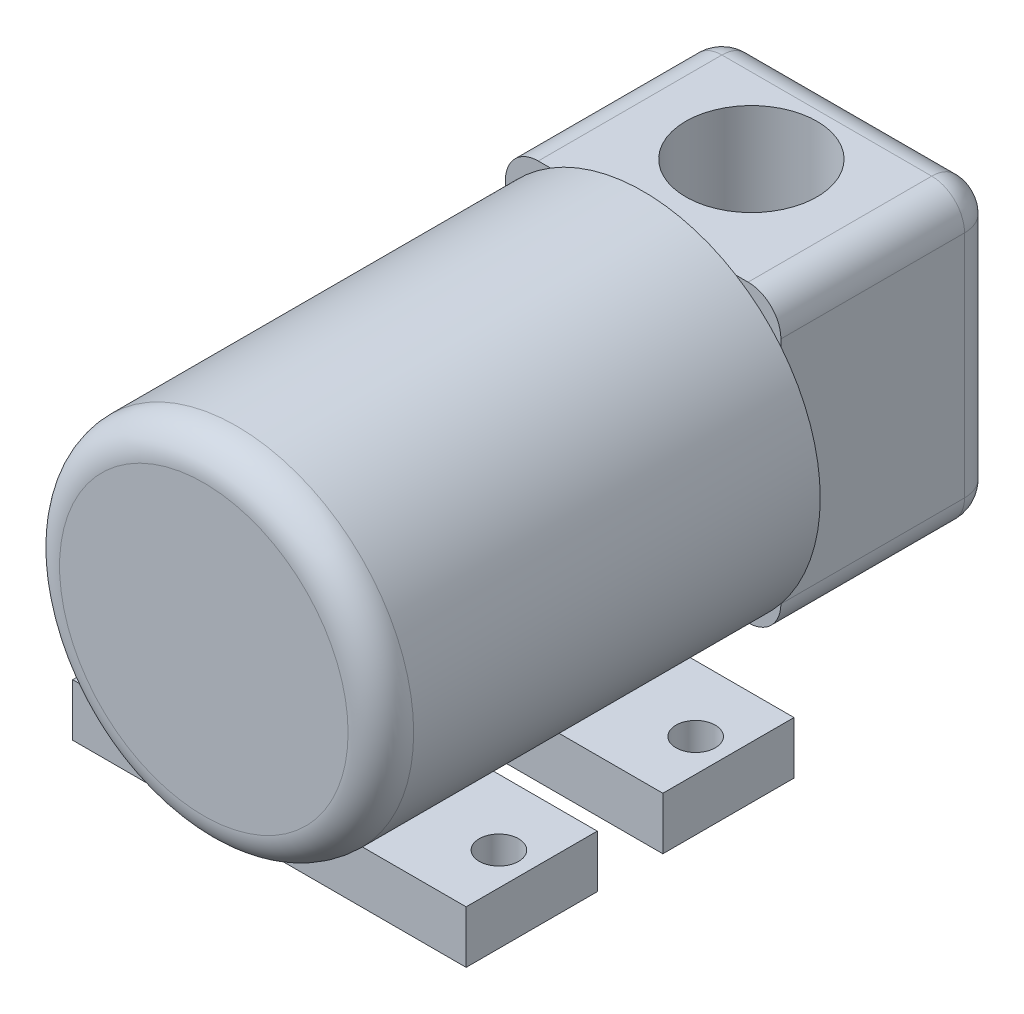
ISO-10303-21;
HEADER;
FILE_DESCRIPTION(('STEP AP214'),'2;1');
FILE_NAME('part.step','',(''),(''),'','','');
FILE_SCHEMA(('AUTOMOTIVE_DESIGN { 1 0 10303 214 1 1 1 1 }'));
ENDSEC;
DATA;
#1=APPLICATION_CONTEXT('core data for automotive mechanical design processes');
#2=APPLICATION_PROTOCOL_DEFINITION('international standard','automotive_design',2000,#1);
#3=PRODUCT_CONTEXT('',#1,'mechanical');
#4=PRODUCT('Part','Part','',(#3));
#5=PRODUCT_RELATED_PRODUCT_CATEGORY('part','',(#4));
#6=PRODUCT_DEFINITION_FORMATION('','',#4);
#7=PRODUCT_DEFINITION_CONTEXT('part definition',#1,'design');
#8=PRODUCT_DEFINITION('design','',#6,#7);
#9=PRODUCT_DEFINITION_SHAPE('','',#8);
#10=(LENGTH_UNIT() NAMED_UNIT(*) SI_UNIT(.MILLI.,.METRE.));
#11=(NAMED_UNIT(*) PLANE_ANGLE_UNIT() SI_UNIT($,.RADIAN.));
#12=(NAMED_UNIT(*) SI_UNIT($,.STERADIAN.) SOLID_ANGLE_UNIT());
#13=UNCERTAINTY_MEASURE_WITH_UNIT(LENGTH_MEASURE(1.E-05),#10,'distance_accuracy_value','');
#14=(GEOMETRIC_REPRESENTATION_CONTEXT(3) GLOBAL_UNCERTAINTY_ASSIGNED_CONTEXT((#13)) GLOBAL_UNIT_ASSIGNED_CONTEXT((#10,
#11,#12)) REPRESENTATION_CONTEXT('',''));
#15=CARTESIAN_POINT('',(0.,0.,0.));
#16=DIRECTION('',(0.,0.,1.));
#17=DIRECTION('',(1.,0.,0.));
#18=AXIS2_PLACEMENT_3D('',#15,#16,#17);
#19=CARTESIAN_POINT('',(0.,0.,-67.));
#20=DIRECTION('',(0.,0.,1.));
#21=DIRECTION('',(1.,0.,0.));
#22=AXIS2_PLACEMENT_3D('',#19,#20,#21);
#23=PLANE('',#22);
#24=DIRECTION('',(0.,-1.,0.));
#25=VECTOR('',#24,1.);
#26=CARTESIAN_POINT('',(21.,23.,-67.));
#27=LINE('',#26,#25);
#28=CARTESIAN_POINT('',(21.,16.9705627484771,-67.));
#29=VERTEX_POINT('',#28);
#30=CARTESIAN_POINT('',(21.,-16.9705627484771,-67.));
#31=VERTEX_POINT('',#30);
#32=EDGE_CURVE('E282',#29,#31,#27,.T.);
#33=ORIENTED_EDGE('',*,*,#32,.F.);
#34=CARTESIAN_POINT('',(0.,0.,-67.));
#35=DIRECTION('',(0.,0.,1.));
#36=DIRECTION('',(1.,0.,0.));
#37=AXIS2_PLACEMENT_3D('',#34,#35,#36);
#38=CIRCLE('',#37,27.);
#39=EDGE_CURVE('E293',#31,#29,#38,.T.);
#40=ORIENTED_EDGE('',*,*,#39,.F.);
#41=EDGE_LOOP('',(#33,#40));
#42=FACE_BOUND('',#41,.T.);
#43=ADVANCED_FACE('F37',(#42),#23,.F.);
#44=DIRECTION('',(1.,0.,0.));
#45=VECTOR('',#44,1.);
#46=CARTESIAN_POINT('',(21.,23.,-67.));
#47=LINE('',#46,#45);
#48=CARTESIAN_POINT('',(-14.142135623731,23.,-67.));
#49=VERTEX_POINT('',#48);
#50=CARTESIAN_POINT('',(14.142135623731,23.,-67.));
#51=VERTEX_POINT('',#50);
#52=EDGE_CURVE('E294',#49,#51,#47,.T.);
#53=ORIENTED_EDGE('',*,*,#52,.F.);
#54=EDGE_CURVE('E298',#51,#49,#38,.T.);
#55=ORIENTED_EDGE('',*,*,#54,.F.);
#56=EDGE_LOOP('',(#53,#55));
#57=FACE_BOUND('',#56,.T.);
#58=ADVANCED_FACE('F433',(#57),#23,.F.);
#59=DIRECTION('',(0.,1.,0.));
#60=VECTOR('',#59,1.);
#61=CARTESIAN_POINT('',(-21.,23.,-67.));
#62=LINE('',#61,#60);
#63=CARTESIAN_POINT('',(-21.,-16.9705627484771,-67.));
#64=VERTEX_POINT('',#63);
#65=CARTESIAN_POINT('',(-21.,16.9705627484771,-67.));
#66=VERTEX_POINT('',#65);
#67=EDGE_CURVE('E290',#64,#66,#62,.T.);
#68=ORIENTED_EDGE('',*,*,#67,.F.);
#69=EDGE_CURVE('E564',#66,#64,#38,.T.);
#70=ORIENTED_EDGE('',*,*,#69,.F.);
#71=EDGE_LOOP('',(#68,#70));
#72=FACE_BOUND('',#71,.T.);
#73=ADVANCED_FACE('F440',(#72),#23,.F.);
#74=DIRECTION('',(-1.,0.,0.));
#75=VECTOR('',#74,1.);
#76=CARTESIAN_POINT('',(21.,-22.,-67.));
#77=LINE('',#76,#75);
#78=CARTESIAN_POINT('',(15.6524758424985,-22.,-67.));
#79=VERTEX_POINT('',#78);
#80=CARTESIAN_POINT('',(-15.6524758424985,-22.,-67.));
#81=VERTEX_POINT('',#80);
#82=EDGE_CURVE('E286',#79,#81,#77,.T.);
#83=ORIENTED_EDGE('',*,*,#82,.F.);
#84=EDGE_CURVE('E459',#81,#79,#38,.T.);
#85=ORIENTED_EDGE('',*,*,#84,.F.);
#86=EDGE_LOOP('',(#83,#85));
#87=FACE_BOUND('',#86,.T.);
#88=ADVANCED_FACE('F436',(#87),#23,.F.);
#89=CARTESIAN_POINT('',(0.,0.,-67.));
#90=DIRECTION('',(0.,0.,1.));
#91=DIRECTION('',(1.,0.,0.));
#92=AXIS2_PLACEMENT_3D('',#89,#90,#91);
#93=CYLINDRICAL_SURFACE('',#92,27.);
#94=DIRECTION('',(0.,0.,1.));
#95=VECTOR('',#94,1.);
#96=CARTESIAN_POINT('',(-12.369316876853,-24.,-67.));
#97=LINE('',#96,#95);
#98=CARTESIAN_POINT('',(-12.369316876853,-24.,-40.));
#99=VERTEX_POINT('',#98);
#100=CARTESIAN_POINT('',(-12.369316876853,-24.,-60.));
#101=VERTEX_POINT('',#100);
#102=EDGE_CURVE('E11',#99,#101,#97,.F.);
#103=ORIENTED_EDGE('',*,*,#102,.F.);
#104=CARTESIAN_POINT('',(0.,0.,-40.));
#105=DIRECTION('',(0.,0.,-1.));
#106=DIRECTION('',(-1.,0.,0.));
#107=AXIS2_PLACEMENT_3D('',#104,#105,#106);
#108=CIRCLE('',#107,27.);
#109=CARTESIAN_POINT('',(12.369316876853,-24.,-40.));
#110=VERTEX_POINT('',#109);
#111=EDGE_CURVE('E45',#99,#110,#108,.F.);
#112=ORIENTED_EDGE('',*,*,#111,.T.);
#113=DIRECTION('',(0.,0.,1.));
#114=VECTOR('',#113,1.);
#115=CARTESIAN_POINT('',(12.369316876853,-24.,-67.));
#116=LINE('',#115,#114);
#117=CARTESIAN_POINT('',(12.369316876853,-24.,-60.));
#118=VERTEX_POINT('',#117);
#119=EDGE_CURVE('E212',#118,#110,#116,.T.);
#120=ORIENTED_EDGE('',*,*,#119,.F.);
#121=CARTESIAN_POINT('',(0.,0.,-60.));
#122=DIRECTION('',(0.,0.,1.));
#123=DIRECTION('',(1.,0.,0.));
#124=AXIS2_PLACEMENT_3D('',#121,#122,#123);
#125=CIRCLE('',#124,27.);
#126=EDGE_CURVE('E55',#118,#101,#125,.F.);
#127=ORIENTED_EDGE('',*,*,#126,.T.);
#128=EDGE_LOOP('',(#103,#112,#120,#127));
#129=FACE_BOUND('',#128,.T.);
#130=DIRECTION('',(0.,0.,1.));
#131=VECTOR('',#130,1.);
#132=CARTESIAN_POINT('',(-12.369316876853,-24.,-67.));
#133=LINE('',#132,#131);
#134=CARTESIAN_POINT('',(-12.369316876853,-24.,-10.));
#135=VERTEX_POINT('',#134);
#136=CARTESIAN_POINT('',(-12.369316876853,-24.,-30.));
#137=VERTEX_POINT('',#136);
#138=EDGE_CURVE('E386',#135,#137,#133,.F.);
#139=ORIENTED_EDGE('',*,*,#138,.F.);
#140=CARTESIAN_POINT('',(0.,0.,-10.));
#141=DIRECTION('',(0.,0.,-1.));
#142=DIRECTION('',(-1.,0.,0.));
#143=AXIS2_PLACEMENT_3D('',#140,#141,#142);
#144=CIRCLE('',#143,27.);
#145=CARTESIAN_POINT('',(12.369316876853,-24.,-10.));
#146=VERTEX_POINT('',#145);
#147=EDGE_CURVE('E384',#135,#146,#144,.F.);
#148=ORIENTED_EDGE('',*,*,#147,.T.);
#149=DIRECTION('',(0.,0.,1.));
#150=VECTOR('',#149,1.);
#151=CARTESIAN_POINT('',(12.369316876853,-24.,-67.));
#152=LINE('',#151,#150);
#153=CARTESIAN_POINT('',(12.369316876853,-24.,-30.));
#154=VERTEX_POINT('',#153);
#155=EDGE_CURVE('E379',#154,#146,#152,.T.);
#156=ORIENTED_EDGE('',*,*,#155,.F.);
#157=CARTESIAN_POINT('',(0.,0.,-30.));
#158=DIRECTION('',(0.,0.,1.));
#159=DIRECTION('',(1.,0.,0.));
#160=AXIS2_PLACEMENT_3D('',#157,#158,#159);
#161=CIRCLE('',#160,27.);
#162=EDGE_CURVE('E382',#154,#137,#161,.F.);
#163=ORIENTED_EDGE('',*,*,#162,.T.);
#164=EDGE_LOOP('',(#139,#148,#156,#163));
#165=FACE_BOUND('',#164,.T.);
#166=CARTESIAN_POINT('',(0.,0.,-5.));
#167=DIRECTION('',(0.,0.,1.));
#168=DIRECTION('',(1.,0.,0.));
#169=AXIS2_PLACEMENT_3D('',#166,#167,#168);
#170=CIRCLE('',#169,27.);
#171=CARTESIAN_POINT('',(27.,0.,-5.));
#172=VERTEX_POINT('',#171);
#173=EDGE_CURVE('E376',#172,#172,#170,.F.);
#174=ORIENTED_EDGE('',*,*,#173,.T.);
#175=EDGE_LOOP('',(#174));
#176=FACE_BOUND('',#175,.T.);
#177=EDGE_CURVE('E295',#29,#51,#38,.T.);
#178=ORIENTED_EDGE('',*,*,#177,.T.);
#179=ORIENTED_EDGE('',*,*,#54,.T.);
#180=EDGE_CURVE('E563',#49,#66,#38,.T.);
#181=ORIENTED_EDGE('',*,*,#180,.T.);
#182=ORIENTED_EDGE('',*,*,#69,.T.);
#183=EDGE_CURVE('E471',#64,#81,#38,.T.);
#184=ORIENTED_EDGE('',*,*,#183,.T.);
#185=ORIENTED_EDGE('',*,*,#84,.T.);
#186=EDGE_CURVE('E467',#79,#31,#38,.T.);
#187=ORIENTED_EDGE('',*,*,#186,.T.);
#188=ORIENTED_EDGE('',*,*,#39,.T.);
#189=EDGE_LOOP('',(#178,#179,#181,#182,#184,#185,#187,#188));
#190=FACE_BOUND('',#189,.T.);
#191=ADVANCED_FACE('F390',(#129,#165,#176,#190),#93,.T.);
#192=CARTESIAN_POINT('',(0.,0.,0.));
#193=DIRECTION('',(0.,0.,1.));
#194=DIRECTION('',(1.,0.,0.));
#195=AXIS2_PLACEMENT_3D('',#192,#193,#194);
#196=PLANE('',#195);
#197=CARTESIAN_POINT('',(0.,0.,0.));
#198=DIRECTION('',(0.,0.,1.));
#199=DIRECTION('',(1.,0.,0.));
#200=AXIS2_PLACEMENT_3D('',#197,#198,#199);
#201=CIRCLE('',#200,22.);
#202=CARTESIAN_POINT('',(22.,0.,0.));
#203=VERTEX_POINT('',#202);
#204=EDGE_CURVE('E341',#203,#203,#201,.T.);
#205=ORIENTED_EDGE('',*,*,#204,.T.);
#206=EDGE_LOOP('',(#205));
#207=FACE_BOUND('',#206,.T.);
#208=ADVANCED_FACE('F452',(#207),#196,.T.);
#209=CARTESIAN_POINT('',(0.,0.,-67.));
#210=DIRECTION('',(0.,0.,-1.));
#211=DIRECTION('',(-1.,0.,0.));
#212=AXIS2_PLACEMENT_3D('',#209,#210,#211);
#213=PLANE('',#212);
#214=CARTESIAN_POINT('',(21.,18.,-67.));
#215=VERTEX_POINT('',#214);
#216=EDGE_CURVE('E279',#215,#29,#27,.T.);
#217=ORIENTED_EDGE('',*,*,#216,.F.);
#218=CARTESIAN_POINT('',(16.,18.,-67.));
#219=DIRECTION('',(0.,0.,-1.));
#220=DIRECTION('',(-1.,0.,0.));
#221=AXIS2_PLACEMENT_3D('',#218,#219,#220);
#222=CIRCLE('',#221,5.);
#223=CARTESIAN_POINT('',(16.,23.,-67.));
#224=VERTEX_POINT('',#223);
#225=EDGE_CURVE('E333',#215,#224,#222,.F.);
#226=ORIENTED_EDGE('',*,*,#225,.T.);
#227=EDGE_CURVE('E289',#51,#224,#47,.T.);
#228=ORIENTED_EDGE('',*,*,#227,.F.);
#229=ORIENTED_EDGE('',*,*,#177,.F.);
#230=EDGE_LOOP('',(#217,#226,#228,#229));
#231=FACE_BOUND('',#230,.T.);
#232=ADVANCED_FACE('F483',(#231),#213,.F.);
#233=CARTESIAN_POINT('',(-16.,23.,-67.));
#234=VERTEX_POINT('',#233);
#235=EDGE_CURVE('E291',#234,#49,#47,.T.);
#236=ORIENTED_EDGE('',*,*,#235,.F.);
#237=CARTESIAN_POINT('',(-16.,18.,-67.));
#238=DIRECTION('',(0.,0.,-1.));
#239=DIRECTION('',(-1.,0.,0.));
#240=AXIS2_PLACEMENT_3D('',#237,#238,#239);
#241=CIRCLE('',#240,5.);
#242=CARTESIAN_POINT('',(-21.,18.,-67.));
#243=VERTEX_POINT('',#242);
#244=EDGE_CURVE('E339',#234,#243,#241,.F.);
#245=ORIENTED_EDGE('',*,*,#244,.T.);
#246=EDGE_CURVE('E285',#66,#243,#62,.T.);
#247=ORIENTED_EDGE('',*,*,#246,.F.);
#248=ORIENTED_EDGE('',*,*,#180,.F.);
#249=EDGE_LOOP('',(#236,#245,#247,#248));
#250=FACE_BOUND('',#249,.T.);
#251=ADVANCED_FACE('F561',(#250),#213,.F.);
#252=CARTESIAN_POINT('',(-21.,-17.,-67.));
#253=VERTEX_POINT('',#252);
#254=EDGE_CURVE('E287',#253,#64,#62,.T.);
#255=ORIENTED_EDGE('',*,*,#254,.F.);
#256=CARTESIAN_POINT('',(-16.,-17.,-67.));
#257=DIRECTION('',(0.,0.,-1.));
#258=DIRECTION('',(-1.,0.,0.));
#259=AXIS2_PLACEMENT_3D('',#256,#257,#258);
#260=CIRCLE('',#259,5.);
#261=CARTESIAN_POINT('',(-16.,-22.,-67.));
#262=VERTEX_POINT('',#261);
#263=EDGE_CURVE('E337',#253,#262,#260,.F.);
#264=ORIENTED_EDGE('',*,*,#263,.T.);
#265=EDGE_CURVE('E281',#81,#262,#77,.T.);
#266=ORIENTED_EDGE('',*,*,#265,.F.);
#267=ORIENTED_EDGE('',*,*,#183,.F.);
#268=EDGE_LOOP('',(#255,#264,#266,#267));
#269=FACE_BOUND('',#268,.T.);
#270=ADVANCED_FACE('F524',(#269),#213,.F.);
#271=CARTESIAN_POINT('',(21.,23.,-100.));
#272=DIRECTION('',(-1.,0.,0.));
#273=DIRECTION('',(0.,-1.,0.));
#274=AXIS2_PLACEMENT_3D('',#271,#272,#273);
#275=PLANE('',#274);
#276=DIRECTION('',(0.,-1.,0.));
#277=VECTOR('',#276,1.);
#278=CARTESIAN_POINT('',(21.,23.,-95.));
#279=LINE('',#278,#277);
#280=CARTESIAN_POINT('',(21.,-17.,-95.));
#281=VERTEX_POINT('',#280);
#282=CARTESIAN_POINT('',(21.,18.,-95.));
#283=VERTEX_POINT('',#282);
#284=EDGE_CURVE('E323',#281,#283,#279,.F.);
#285=ORIENTED_EDGE('',*,*,#284,.T.);
#286=DIRECTION('',(0.,0.,1.));
#287=VECTOR('',#286,1.);
#288=CARTESIAN_POINT('',(21.,18.,-100.));
#289=LINE('',#288,#287);
#290=EDGE_CURVE('E325',#283,#215,#289,.T.);
#291=ORIENTED_EDGE('',*,*,#290,.T.);
#292=ORIENTED_EDGE('',*,*,#216,.T.);
#293=ORIENTED_EDGE('',*,*,#32,.T.);
#294=CARTESIAN_POINT('',(21.,-17.,-67.));
#295=VERTEX_POINT('',#294);
#296=EDGE_CURVE('E278',#31,#295,#27,.T.);
#297=ORIENTED_EDGE('',*,*,#296,.T.);
#298=DIRECTION('',(0.,0.,1.));
#299=VECTOR('',#298,1.);
#300=CARTESIAN_POINT('',(21.,-17.,-100.));
#301=LINE('',#300,#299);
#302=EDGE_CURVE('E321',#295,#281,#301,.F.);
#303=ORIENTED_EDGE('',*,*,#302,.T.);
#304=EDGE_LOOP('',(#285,#291,#292,#293,#297,#303));
#305=FACE_BOUND('',#304,.T.);
#306=ADVANCED_FACE('F550',(#305),#275,.F.);
#307=CARTESIAN_POINT('',(21.,-22.,-100.));
#308=DIRECTION('',(0.,1.,0.));
#309=DIRECTION('',(0.,0.,1.));
#310=AXIS2_PLACEMENT_3D('',#307,#308,#309);
#311=PLANE('',#310);
#312=CARTESIAN_POINT('',(0.,-22.,-83.5));
#313=DIRECTION('',(0.,1.,0.));
#314=DIRECTION('',(0.,0.,1.));
#315=AXIS2_PLACEMENT_3D('',#312,#313,#314);
#316=CIRCLE('',#315,9.99999999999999);
#317=CARTESIAN_POINT('',(0.,-22.,-73.5));
#318=VERTEX_POINT('',#317);
#319=EDGE_CURVE('E274',#318,#318,#316,.T.);
#320=ORIENTED_EDGE('',*,*,#319,.T.);
#321=EDGE_LOOP('',(#320));
#322=FACE_BOUND('',#321,.T.);
#323=DIRECTION('',(-1.,0.,0.));
#324=VECTOR('',#323,1.);
#325=CARTESIAN_POINT('',(21.,-22.,-95.));
#326=LINE('',#325,#324);
#327=CARTESIAN_POINT('',(-16.,-22.,-95.));
#328=VERTEX_POINT('',#327);
#329=CARTESIAN_POINT('',(16.,-22.,-95.));
#330=VERTEX_POINT('',#329);
#331=EDGE_CURVE('E310',#328,#330,#326,.F.);
#332=ORIENTED_EDGE('',*,*,#331,.T.);
#333=DIRECTION('',(0.,0.,1.));
#334=VECTOR('',#333,1.);
#335=CARTESIAN_POINT('',(16.,-22.,-100.));
#336=LINE('',#335,#334);
#337=CARTESIAN_POINT('',(16.,-22.,-67.));
#338=VERTEX_POINT('',#337);
#339=EDGE_CURVE('E313',#330,#338,#336,.T.);
#340=ORIENTED_EDGE('',*,*,#339,.T.);
#341=EDGE_CURVE('E283',#338,#79,#77,.T.);
#342=ORIENTED_EDGE('',*,*,#341,.T.);
#343=ORIENTED_EDGE('',*,*,#82,.T.);
#344=ORIENTED_EDGE('',*,*,#265,.T.);
#345=DIRECTION('',(0.,0.,1.));
#346=VECTOR('',#345,1.);
#347=CARTESIAN_POINT('',(-16.,-22.,-100.));
#348=LINE('',#347,#346);
#349=EDGE_CURVE('E308',#262,#328,#348,.F.);
#350=ORIENTED_EDGE('',*,*,#349,.T.);
#351=EDGE_LOOP('',(#332,#340,#342,#343,#344,#350));
#352=FACE_BOUND('',#351,.T.);
#353=ADVANCED_FACE('F525',(#322,#352),#311,.F.);
#354=CARTESIAN_POINT('',(-21.,23.,-100.));
#355=DIRECTION('',(1.,0.,0.));
#356=DIRECTION('',(0.,1.,0.));
#357=AXIS2_PLACEMENT_3D('',#354,#355,#356);
#358=PLANE('',#357);
#359=DIRECTION('',(0.,1.,0.));
#360=VECTOR('',#359,1.);
#361=CARTESIAN_POINT('',(-21.,-22.,-95.));
#362=LINE('',#361,#360);
#363=CARTESIAN_POINT('',(-21.,18.,-95.));
#364=VERTEX_POINT('',#363);
#365=CARTESIAN_POINT('',(-21.,-17.,-95.));
#366=VERTEX_POINT('',#365);
#367=EDGE_CURVE('E317',#364,#366,#362,.F.);
#368=ORIENTED_EDGE('',*,*,#367,.T.);
#369=DIRECTION('',(0.,0.,1.));
#370=VECTOR('',#369,1.);
#371=CARTESIAN_POINT('',(-21.,-17.,-100.));
#372=LINE('',#371,#370);
#373=EDGE_CURVE('E319',#366,#253,#372,.T.);
#374=ORIENTED_EDGE('',*,*,#373,.T.);
#375=ORIENTED_EDGE('',*,*,#254,.T.);
#376=ORIENTED_EDGE('',*,*,#67,.T.);
#377=ORIENTED_EDGE('',*,*,#246,.T.);
#378=DIRECTION('',(0.,0.,1.));
#379=VECTOR('',#378,1.);
#380=CARTESIAN_POINT('',(-21.,18.,-100.));
#381=LINE('',#380,#379);
#382=EDGE_CURVE('E315',#243,#364,#381,.F.);
#383=ORIENTED_EDGE('',*,*,#382,.T.);
#384=EDGE_LOOP('',(#368,#374,#375,#376,#377,#383));
#385=FACE_BOUND('',#384,.T.);
#386=ADVANCED_FACE('F498',(#385),#358,.F.);
#387=CARTESIAN_POINT('',(21.,23.,-100.));
#388=DIRECTION('',(0.,-1.,0.));
#389=DIRECTION('',(0.,0.,-1.));
#390=AXIS2_PLACEMENT_3D('',#387,#388,#389);
#391=PLANE('',#390);
#392=CARTESIAN_POINT('',(0.,23.,-83.5));
#393=DIRECTION('',(0.,1.,0.));
#394=DIRECTION('',(-1.,0.,0.));
#395=AXIS2_PLACEMENT_3D('',#392,#393,#394);
#396=CIRCLE('',#395,9.99999999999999);
#397=CARTESIAN_POINT('',(-9.99999999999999,23.,-83.5));
#398=VERTEX_POINT('',#397);
#399=EDGE_CURVE('E271',#398,#398,#396,.T.);
#400=ORIENTED_EDGE('',*,*,#399,.F.);
#401=EDGE_LOOP('',(#400));
#402=FACE_BOUND('',#401,.T.);
#403=ORIENTED_EDGE('',*,*,#227,.T.);
#404=DIRECTION('',(0.,0.,1.));
#405=VECTOR('',#404,1.);
#406=CARTESIAN_POINT('',(16.,23.,-100.));
#407=LINE('',#406,#405);
#408=CARTESIAN_POINT('',(16.,23.,-95.));
#409=VERTEX_POINT('',#408);
#410=EDGE_CURVE('E331',#224,#409,#407,.F.);
#411=ORIENTED_EDGE('',*,*,#410,.T.);
#412=DIRECTION('',(1.,0.,0.));
#413=VECTOR('',#412,1.);
#414=CARTESIAN_POINT('',(-21.,23.,-95.));
#415=LINE('',#414,#413);
#416=CARTESIAN_POINT('',(-16.,23.,-95.));
#417=VERTEX_POINT('',#416);
#418=EDGE_CURVE('E329',#409,#417,#415,.F.);
#419=ORIENTED_EDGE('',*,*,#418,.T.);
#420=DIRECTION('',(0.,0.,1.));
#421=VECTOR('',#420,1.);
#422=CARTESIAN_POINT('',(-16.,23.,-100.));
#423=LINE('',#422,#421);
#424=EDGE_CURVE('E327',#417,#234,#423,.T.);
#425=ORIENTED_EDGE('',*,*,#424,.T.);
#426=ORIENTED_EDGE('',*,*,#235,.T.);
#427=ORIENTED_EDGE('',*,*,#52,.T.);
#428=EDGE_LOOP('',(#403,#411,#419,#425,#426,#427));
#429=FACE_BOUND('',#428,.T.);
#430=ADVANCED_FACE('F490',(#402,#429),#391,.F.);
#431=CARTESIAN_POINT('',(0.,0.,-100.));
#432=DIRECTION('',(0.,0.,-1.));
#433=DIRECTION('',(-1.,0.,0.));
#434=AXIS2_PLACEMENT_3D('',#431,#432,#433);
#435=PLANE('',#434);
#436=DIRECTION('',(0.,-1.,0.));
#437=VECTOR('',#436,1.);
#438=CARTESIAN_POINT('',(16.,-22.,-100.));
#439=LINE('',#438,#437);
#440=CARTESIAN_POINT('',(16.,18.,-100.));
#441=VERTEX_POINT('',#440);
#442=CARTESIAN_POINT('',(16.,-17.,-100.));
#443=VERTEX_POINT('',#442);
#444=EDGE_CURVE('E301',#441,#443,#439,.T.);
#445=ORIENTED_EDGE('',*,*,#444,.T.);
#446=DIRECTION('',(-1.,0.,0.));
#447=VECTOR('',#446,1.);
#448=CARTESIAN_POINT('',(-21.,-17.,-100.));
#449=LINE('',#448,#447);
#450=CARTESIAN_POINT('',(-16.,-17.,-100.));
#451=VERTEX_POINT('',#450);
#452=EDGE_CURVE('E305',#443,#451,#449,.T.);
#453=ORIENTED_EDGE('',*,*,#452,.T.);
#454=DIRECTION('',(0.,1.,0.));
#455=VECTOR('',#454,1.);
#456=CARTESIAN_POINT('',(-16.,23.,-100.));
#457=LINE('',#456,#455);
#458=CARTESIAN_POINT('',(-16.,18.,-100.));
#459=VERTEX_POINT('',#458);
#460=EDGE_CURVE('E303',#451,#459,#457,.T.);
#461=ORIENTED_EDGE('',*,*,#460,.T.);
#462=DIRECTION('',(1.,0.,0.));
#463=VECTOR('',#462,1.);
#464=CARTESIAN_POINT('',(21.,18.,-100.));
#465=LINE('',#464,#463);
#466=EDGE_CURVE('E299',#459,#441,#465,.T.);
#467=ORIENTED_EDGE('',*,*,#466,.T.);
#468=EDGE_LOOP('',(#445,#453,#461,#467));
#469=FACE_BOUND('',#468,.T.);
#470=ADVANCED_FACE('F536',(#469),#435,.T.);
#471=ORIENTED_EDGE('',*,*,#341,.F.);
#472=CARTESIAN_POINT('',(16.,-17.,-67.));
#473=DIRECTION('',(0.,0.,-1.));
#474=DIRECTION('',(-1.,0.,0.));
#475=AXIS2_PLACEMENT_3D('',#472,#473,#474);
#476=CIRCLE('',#475,5.);
#477=EDGE_CURVE('E335',#338,#295,#476,.F.);
#478=ORIENTED_EDGE('',*,*,#477,.T.);
#479=ORIENTED_EDGE('',*,*,#296,.F.);
#480=ORIENTED_EDGE('',*,*,#186,.F.);
#481=EDGE_LOOP('',(#471,#478,#479,#480));
#482=FACE_BOUND('',#481,.T.);
#483=ADVANCED_FACE('F474',(#482),#213,.F.);
#484=CARTESIAN_POINT('',(0.,-61.,-83.5));
#485=DIRECTION('',(0.,1.,0.));
#486=DIRECTION('',(-1.,0.,0.));
#487=AXIS2_PLACEMENT_3D('',#484,#485,#486);
#488=CYLINDRICAL_SURFACE('',#487,9.99999999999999);
#489=ORIENTED_EDGE('',*,*,#399,.T.);
#490=EDGE_LOOP('',(#489));
#491=FACE_BOUND('',#490,.T.);
#492=ORIENTED_EDGE('',*,*,#319,.F.);
#493=EDGE_LOOP('',(#492));
#494=FACE_BOUND('',#493,.T.);
#495=ADVANCED_FACE('F574',(#491,#494),#488,.F.);
#496=CARTESIAN_POINT('',(16.,18.,-100.));
#497=DIRECTION('',(0.,0.,1.));
#498=DIRECTION('',(1.,0.,0.));
#499=AXIS2_PLACEMENT_3D('',#496,#497,#498);
#500=CYLINDRICAL_SURFACE('',#499,5.);
#501=ORIENTED_EDGE('',*,*,#225,.F.);
#502=ORIENTED_EDGE('',*,*,#290,.F.);
#503=CARTESIAN_POINT('',(16.,18.,-95.));
#504=DIRECTION('',(0.,0.,-1.));
#505=DIRECTION('',(-1.,0.,0.));
#506=AXIS2_PLACEMENT_3D('',#503,#504,#505);
#507=CIRCLE('',#506,5.);
#508=EDGE_CURVE('E275',#409,#283,#507,.T.);
#509=ORIENTED_EDGE('',*,*,#508,.F.);
#510=ORIENTED_EDGE('',*,*,#410,.F.);
#511=EDGE_LOOP('',(#501,#502,#509,#510));
#512=FACE_BOUND('',#511,.T.);
#513=ADVANCED_FACE('F554',(#512),#500,.T.);
#514=CARTESIAN_POINT('',(0.,18.,-95.));
#515=DIRECTION('',(-1.,0.,0.));
#516=DIRECTION('',(0.,0.,1.));
#517=AXIS2_PLACEMENT_3D('',#514,#515,#516);
#518=CYLINDRICAL_SURFACE('',#517,5.);
#519=CARTESIAN_POINT('',(-16.,18.,-95.));
#520=DIRECTION('',(-1.,0.,0.));
#521=DIRECTION('',(0.,0.,1.));
#522=AXIS2_PLACEMENT_3D('',#519,#520,#521);
#523=CIRCLE('',#522,5.);
#524=EDGE_CURVE('E366',#417,#459,#523,.T.);
#525=ORIENTED_EDGE('',*,*,#524,.F.);
#526=ORIENTED_EDGE('',*,*,#418,.F.);
#527=CARTESIAN_POINT('',(16.,18.,-95.));
#528=DIRECTION('',(1.,0.,0.));
#529=DIRECTION('',(0.,0.,-1.));
#530=AXIS2_PLACEMENT_3D('',#527,#528,#529);
#531=CIRCLE('',#530,5.);
#532=EDGE_CURVE('E369',#441,#409,#531,.T.);
#533=ORIENTED_EDGE('',*,*,#532,.F.);
#534=ORIENTED_EDGE('',*,*,#466,.F.);
#535=EDGE_LOOP('',(#525,#526,#533,#534));
#536=FACE_BOUND('',#535,.T.);
#537=ADVANCED_FACE('F560',(#536),#518,.T.);
#538=CARTESIAN_POINT('',(-16.,18.,-100.));
#539=DIRECTION('',(0.,0.,1.));
#540=DIRECTION('',(1.,0.,0.));
#541=AXIS2_PLACEMENT_3D('',#538,#539,#540);
#542=CYLINDRICAL_SURFACE('',#541,5.);
#543=ORIENTED_EDGE('',*,*,#244,.F.);
#544=ORIENTED_EDGE('',*,*,#424,.F.);
#545=CARTESIAN_POINT('',(-16.,18.,-95.));
#546=DIRECTION('',(0.,0.,-1.));
#547=DIRECTION('',(-1.,0.,0.));
#548=AXIS2_PLACEMENT_3D('',#545,#546,#547);
#549=CIRCLE('',#548,5.);
#550=EDGE_CURVE('E363',#364,#417,#549,.T.);
#551=ORIENTED_EDGE('',*,*,#550,.F.);
#552=ORIENTED_EDGE('',*,*,#382,.F.);
#553=EDGE_LOOP('',(#543,#544,#551,#552));
#554=FACE_BOUND('',#553,.T.);
#555=ADVANCED_FACE('F504',(#554),#542,.T.);
#556=CARTESIAN_POINT('',(16.,18.,-95.));
#557=DIRECTION('',(0.,0.,1.));
#558=DIRECTION('',(1.,0.,0.));
#559=AXIS2_PLACEMENT_3D('',#556,#557,#558);
#560=SPHERICAL_SURFACE('',#559,5.);
#561=ORIENTED_EDGE('',*,*,#532,.T.);
#562=ORIENTED_EDGE('',*,*,#508,.T.);
#563=CARTESIAN_POINT('',(16.,18.,-95.));
#564=DIRECTION('',(0.,1.,0.));
#565=DIRECTION('',(0.,0.,1.));
#566=AXIS2_PLACEMENT_3D('',#563,#564,#565);
#567=CIRCLE('',#566,5.);
#568=EDGE_CURVE('E360',#441,#283,#567,.F.);
#569=ORIENTED_EDGE('',*,*,#568,.F.);
#570=EDGE_LOOP('',(#561,#562,#569));
#571=FACE_BOUND('',#570,.T.);
#572=ADVANCED_FACE('F557',(#571),#560,.T.);
#573=CARTESIAN_POINT('',(-16.,18.,-95.));
#574=DIRECTION('',(0.,0.,1.));
#575=DIRECTION('',(1.,0.,0.));
#576=AXIS2_PLACEMENT_3D('',#573,#574,#575);
#577=SPHERICAL_SURFACE('',#576,5.);
#578=ORIENTED_EDGE('',*,*,#550,.T.);
#579=ORIENTED_EDGE('',*,*,#524,.T.);
#580=CARTESIAN_POINT('',(-16.,18.,-95.));
#581=DIRECTION('',(0.,1.,0.));
#582=DIRECTION('',(0.,0.,1.));
#583=AXIS2_PLACEMENT_3D('',#580,#581,#582);
#584=CIRCLE('',#583,5.);
#585=EDGE_CURVE('E357',#364,#459,#584,.F.);
#586=ORIENTED_EDGE('',*,*,#585,.F.);
#587=EDGE_LOOP('',(#578,#579,#586));
#588=FACE_BOUND('',#587,.T.);
#589=ADVANCED_FACE('F510',(#588),#577,.T.);
#590=CARTESIAN_POINT('',(16.,-17.,-100.));
#591=DIRECTION('',(0.,0.,1.));
#592=DIRECTION('',(1.,0.,0.));
#593=AXIS2_PLACEMENT_3D('',#590,#591,#592);
#594=CYLINDRICAL_SURFACE('',#593,5.);
#595=ORIENTED_EDGE('',*,*,#477,.F.);
#596=ORIENTED_EDGE('',*,*,#339,.F.);
#597=CARTESIAN_POINT('',(16.,-17.,-95.));
#598=DIRECTION('',(0.,0.,-1.));
#599=DIRECTION('',(-1.,0.,0.));
#600=AXIS2_PLACEMENT_3D('',#597,#598,#599);
#601=CIRCLE('',#600,5.);
#602=EDGE_CURVE('E354',#281,#330,#601,.T.);
#603=ORIENTED_EDGE('',*,*,#602,.F.);
#604=ORIENTED_EDGE('',*,*,#302,.F.);
#605=EDGE_LOOP('',(#595,#596,#603,#604));
#606=FACE_BOUND('',#605,.T.);
#607=ADVANCED_FACE('F548',(#606),#594,.T.);
#608=CARTESIAN_POINT('',(16.,0.,-95.));
#609=DIRECTION('',(0.,1.,0.));
#610=DIRECTION('',(-1.,0.,0.));
#611=AXIS2_PLACEMENT_3D('',#608,#609,#610);
#612=CYLINDRICAL_SURFACE('',#611,5.);
#613=ORIENTED_EDGE('',*,*,#568,.T.);
#614=ORIENTED_EDGE('',*,*,#284,.F.);
#615=CARTESIAN_POINT('',(16.,-17.,-95.));
#616=DIRECTION('',(0.,-1.,0.));
#617=DIRECTION('',(0.,0.,-1.));
#618=AXIS2_PLACEMENT_3D('',#615,#616,#617);
#619=CIRCLE('',#618,5.);
#620=EDGE_CURVE('E351',#443,#281,#619,.T.);
#621=ORIENTED_EDGE('',*,*,#620,.F.);
#622=ORIENTED_EDGE('',*,*,#444,.F.);
#623=EDGE_LOOP('',(#613,#614,#621,#622));
#624=FACE_BOUND('',#623,.T.);
#625=ADVANCED_FACE('F542',(#624),#612,.T.);
#626=CARTESIAN_POINT('',(-16.,0.,-95.));
#627=DIRECTION('',(0.,-1.,0.));
#628=DIRECTION('',(1.,0.,0.));
#629=AXIS2_PLACEMENT_3D('',#626,#627,#628);
#630=CYLINDRICAL_SURFACE('',#629,5.);
#631=ORIENTED_EDGE('',*,*,#585,.T.);
#632=ORIENTED_EDGE('',*,*,#460,.F.);
#633=CARTESIAN_POINT('',(-16.,-17.,-95.));
#634=DIRECTION('',(0.,-1.,0.));
#635=DIRECTION('',(0.,0.,-1.));
#636=AXIS2_PLACEMENT_3D('',#633,#634,#635);
#637=CIRCLE('',#636,5.);
#638=EDGE_CURVE('E348',#366,#451,#637,.T.);
#639=ORIENTED_EDGE('',*,*,#638,.F.);
#640=ORIENTED_EDGE('',*,*,#367,.F.);
#641=EDGE_LOOP('',(#631,#632,#639,#640));
#642=FACE_BOUND('',#641,.T.);
#643=ADVANCED_FACE('F514',(#642),#630,.T.);
#644=CARTESIAN_POINT('',(-16.,-17.,-100.));
#645=DIRECTION('',(0.,0.,1.));
#646=DIRECTION('',(1.,0.,0.));
#647=AXIS2_PLACEMENT_3D('',#644,#645,#646);
#648=CYLINDRICAL_SURFACE('',#647,5.);
#649=ORIENTED_EDGE('',*,*,#263,.F.);
#650=ORIENTED_EDGE('',*,*,#373,.F.);
#651=CARTESIAN_POINT('',(-16.,-17.,-95.));
#652=DIRECTION('',(0.,0.,-1.));
#653=DIRECTION('',(-1.,0.,0.));
#654=AXIS2_PLACEMENT_3D('',#651,#652,#653);
#655=CIRCLE('',#654,5.);
#656=EDGE_CURVE('E345',#328,#366,#655,.T.);
#657=ORIENTED_EDGE('',*,*,#656,.F.);
#658=ORIENTED_EDGE('',*,*,#349,.F.);
#659=EDGE_LOOP('',(#649,#650,#657,#658));
#660=FACE_BOUND('',#659,.T.);
#661=ADVANCED_FACE('F520',(#660),#648,.T.);
#662=CARTESIAN_POINT('',(16.,-17.,-95.));
#663=DIRECTION('',(0.,0.,1.));
#664=DIRECTION('',(1.,0.,0.));
#665=AXIS2_PLACEMENT_3D('',#662,#663,#664);
#666=SPHERICAL_SURFACE('',#665,5.);
#667=ORIENTED_EDGE('',*,*,#620,.T.);
#668=ORIENTED_EDGE('',*,*,#602,.T.);
#669=CARTESIAN_POINT('',(16.,-17.,-95.));
#670=DIRECTION('',(1.,0.,0.));
#671=DIRECTION('',(0.,0.,-1.));
#672=AXIS2_PLACEMENT_3D('',#669,#670,#671);
#673=CIRCLE('',#672,5.);
#674=EDGE_CURVE('E343',#443,#330,#673,.F.);
#675=ORIENTED_EDGE('',*,*,#674,.F.);
#676=EDGE_LOOP('',(#667,#668,#675));
#677=FACE_BOUND('',#676,.T.);
#678=ADVANCED_FACE('F545',(#677),#666,.T.);
#679=CARTESIAN_POINT('',(-16.,-17.,-95.));
#680=DIRECTION('',(0.,0.,1.));
#681=DIRECTION('',(1.,0.,0.));
#682=AXIS2_PLACEMENT_3D('',#679,#680,#681);
#683=SPHERICAL_SURFACE('',#682,5.);
#684=ORIENTED_EDGE('',*,*,#656,.T.);
#685=ORIENTED_EDGE('',*,*,#638,.T.);
#686=CARTESIAN_POINT('',(-16.,-17.,-95.));
#687=DIRECTION('',(-1.,0.,0.));
#688=DIRECTION('',(0.,0.,1.));
#689=AXIS2_PLACEMENT_3D('',#686,#687,#688);
#690=CIRCLE('',#689,5.);
#691=EDGE_CURVE('E270',#328,#451,#690,.F.);
#692=ORIENTED_EDGE('',*,*,#691,.F.);
#693=EDGE_LOOP('',(#684,#685,#692));
#694=FACE_BOUND('',#693,.T.);
#695=ADVANCED_FACE('F533',(#694),#683,.T.);
#696=CARTESIAN_POINT('',(0.,-17.,-95.));
#697=DIRECTION('',(1.,0.,0.));
#698=DIRECTION('',(0.,0.,-1.));
#699=AXIS2_PLACEMENT_3D('',#696,#697,#698);
#700=CYLINDRICAL_SURFACE('',#699,5.);
#701=ORIENTED_EDGE('',*,*,#674,.T.);
#702=ORIENTED_EDGE('',*,*,#331,.F.);
#703=ORIENTED_EDGE('',*,*,#691,.T.);
#704=ORIENTED_EDGE('',*,*,#452,.F.);
#705=EDGE_LOOP('',(#701,#702,#703,#704));
#706=FACE_BOUND('',#705,.T.);
#707=ADVANCED_FACE('F529',(#706),#700,.T.);
#708=CARTESIAN_POINT('',(0.,0.,-5.));
#709=DIRECTION('',(0.,0.,1.));
#710=DIRECTION('',(1.,0.,0.));
#711=AXIS2_PLACEMENT_3D('',#708,#709,#710);
#712=TOROIDAL_SURFACE('',#711,22.,5.);
#713=ORIENTED_EDGE('',*,*,#173,.F.);
#714=EDGE_LOOP('',(#713));
#715=FACE_BOUND('',#714,.T.);
#716=ORIENTED_EDGE('',*,*,#204,.F.);
#717=EDGE_LOOP('',(#716));
#718=FACE_BOUND('',#717,.T.);
#719=ADVANCED_FACE('F39',(#715,#718),#712,.T.);
#720=CARTESIAN_POINT('',(0.,-24.,0.));
#721=DIRECTION('',(0.,1.,0.));
#722=DIRECTION('',(0.,0.,1.));
#723=AXIS2_PLACEMENT_3D('',#720,#721,#722);
#724=PLANE('',#723);
#725=CARTESIAN_POINT('',(-24.9999999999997,-24.,-20.));
#726=DIRECTION('',(0.,1.,0.));
#727=DIRECTION('',(0.,0.,1.));
#728=AXIS2_PLACEMENT_3D('',#725,#726,#727);
#729=CIRCLE('',#728,3.);
#730=CARTESIAN_POINT('',(-24.9999999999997,-24.,-17.));
#731=VERTEX_POINT('',#730);
#732=EDGE_CURVE('E823',#731,#731,#729,.T.);
#733=ORIENTED_EDGE('',*,*,#732,.F.);
#734=EDGE_LOOP('',(#733));
#735=FACE_BOUND('',#734,.T.);
#736=DIRECTION('',(1.,0.,0.));
#737=VECTOR('',#736,1.);
#738=CARTESIAN_POINT('',(-30.0000000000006,-24.,-10.));
#739=LINE('',#738,#737);
#740=CARTESIAN_POINT('',(-30.0000000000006,-24.,-10.));
#741=VERTEX_POINT('',#740);
#742=EDGE_CURVE('E241',#741,#135,#739,.T.);
#743=ORIENTED_EDGE('',*,*,#742,.T.);
#744=ORIENTED_EDGE('',*,*,#138,.T.);
#745=DIRECTION('',(-1.,0.,0.));
#746=VECTOR('',#745,1.);
#747=CARTESIAN_POINT('',(-29.9999999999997,-24.,-30.));
#748=LINE('',#747,#746);
#749=CARTESIAN_POINT('',(-29.9999999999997,-24.,-30.));
#750=VERTEX_POINT('',#749);
#751=EDGE_CURVE('E247',#137,#750,#748,.T.);
#752=ORIENTED_EDGE('',*,*,#751,.T.);
#753=DIRECTION('',(0.,0.,1.));
#754=VECTOR('',#753,1.);
#755=CARTESIAN_POINT('',(-30.0000000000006,-24.,-10.));
#756=LINE('',#755,#754);
#757=EDGE_CURVE('E251',#750,#741,#756,.T.);
#758=ORIENTED_EDGE('',*,*,#757,.T.);
#759=EDGE_LOOP('',(#743,#744,#752,#758));
#760=FACE_BOUND('',#759,.T.);
#761=ADVANCED_FACE('F693',(#735,#760),#724,.T.);
#762=CARTESIAN_POINT('',(-30.0000000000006,-24.,-10.));
#763=DIRECTION('',(0.,0.,-1.));
#764=DIRECTION('',(-1.,0.,0.));
#765=AXIS2_PLACEMENT_3D('',#762,#763,#764);
#766=PLANE('',#765);
#767=ORIENTED_EDGE('',*,*,#147,.F.);
#768=ORIENTED_EDGE('',*,*,#742,.F.);
#769=DIRECTION('',(0.,-1.,0.));
#770=VECTOR('',#769,1.);
#771=CARTESIAN_POINT('',(-30.0000000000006,-24.,-10.));
#772=LINE('',#771,#770);
#773=CARTESIAN_POINT('',(-30.0000000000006,-32.,-10.));
#774=VERTEX_POINT('',#773);
#775=EDGE_CURVE('E252',#741,#774,#772,.T.);
#776=ORIENTED_EDGE('',*,*,#775,.T.);
#777=DIRECTION('',(1.,0.,0.));
#778=VECTOR('',#777,1.);
#779=CARTESIAN_POINT('',(-30.0000000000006,-32.,-10.));
#780=LINE('',#779,#778);
#781=CARTESIAN_POINT('',(30.0000000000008,-32.,-10.));
#782=VERTEX_POINT('',#781);
#783=EDGE_CURVE('E232',#774,#782,#780,.T.);
#784=ORIENTED_EDGE('',*,*,#783,.T.);
#785=DIRECTION('',(0.,-1.,0.));
#786=VECTOR('',#785,1.);
#787=CARTESIAN_POINT('',(30.0000000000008,-24.,-10.));
#788=LINE('',#787,#786);
#789=CARTESIAN_POINT('',(30.0000000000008,-24.,-10.));
#790=VERTEX_POINT('',#789);
#791=EDGE_CURVE('E267',#790,#782,#788,.T.);
#792=ORIENTED_EDGE('',*,*,#791,.F.);
#793=EDGE_CURVE('E245',#146,#790,#739,.T.);
#794=ORIENTED_EDGE('',*,*,#793,.F.);
#795=EDGE_LOOP('',(#767,#768,#776,#784,#792,#794));
#796=FACE_BOUND('',#795,.T.);
#797=ADVANCED_FACE('F702',(#796),#766,.F.);
#798=CARTESIAN_POINT('',(30.0000000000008,-24.,-10.));
#799=DIRECTION('',(-1.,0.,0.));
#800=DIRECTION('',(0.,0.,1.));
#801=AXIS2_PLACEMENT_3D('',#798,#799,#800);
#802=PLANE('',#801);
#803=DIRECTION('',(0.,0.,-1.));
#804=VECTOR('',#803,1.);
#805=CARTESIAN_POINT('',(30.0000000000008,-32.,-10.));
#806=LINE('',#805,#804);
#807=CARTESIAN_POINT('',(29.9999999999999,-32.,-30.));
#808=VERTEX_POINT('',#807);
#809=EDGE_CURVE('E235',#782,#808,#806,.T.);
#810=ORIENTED_EDGE('',*,*,#809,.T.);
#811=DIRECTION('',(0.,-1.,0.));
#812=VECTOR('',#811,1.);
#813=CARTESIAN_POINT('',(29.9999999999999,-24.,-30.));
#814=LINE('',#813,#812);
#815=CARTESIAN_POINT('',(29.9999999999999,-24.,-30.));
#816=VERTEX_POINT('',#815);
#817=EDGE_CURVE('E264',#816,#808,#814,.T.);
#818=ORIENTED_EDGE('',*,*,#817,.F.);
#819=DIRECTION('',(0.,0.,-1.));
#820=VECTOR('',#819,1.);
#821=CARTESIAN_POINT('',(30.0000000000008,-24.,-10.));
#822=LINE('',#821,#820);
#823=EDGE_CURVE('E244',#790,#816,#822,.T.);
#824=ORIENTED_EDGE('',*,*,#823,.F.);
#825=ORIENTED_EDGE('',*,*,#791,.T.);
#826=EDGE_LOOP('',(#810,#818,#824,#825));
#827=FACE_BOUND('',#826,.T.);
#828=ADVANCED_FACE('F706',(#827),#802,.F.);
#829=CARTESIAN_POINT('',(-29.9999999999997,-24.,-30.));
#830=DIRECTION('',(0.,0.,1.));
#831=DIRECTION('',(1.,0.,0.));
#832=AXIS2_PLACEMENT_3D('',#829,#830,#831);
#833=PLANE('',#832);
#834=ORIENTED_EDGE('',*,*,#162,.F.);
#835=EDGE_CURVE('E248',#816,#154,#748,.T.);
#836=ORIENTED_EDGE('',*,*,#835,.F.);
#837=ORIENTED_EDGE('',*,*,#817,.T.);
#838=DIRECTION('',(-1.,0.,0.));
#839=VECTOR('',#838,1.);
#840=CARTESIAN_POINT('',(-29.9999999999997,-32.,-30.));
#841=LINE('',#840,#839);
#842=CARTESIAN_POINT('',(-29.9999999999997,-32.,-30.));
#843=VERTEX_POINT('',#842);
#844=EDGE_CURVE('E255',#808,#843,#841,.T.);
#845=ORIENTED_EDGE('',*,*,#844,.T.);
#846=DIRECTION('',(0.,-1.,0.));
#847=VECTOR('',#846,1.);
#848=CARTESIAN_POINT('',(-29.9999999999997,-24.,-30.));
#849=LINE('',#848,#847);
#850=EDGE_CURVE('E261',#750,#843,#849,.T.);
#851=ORIENTED_EDGE('',*,*,#850,.F.);
#852=ORIENTED_EDGE('',*,*,#751,.F.);
#853=EDGE_LOOP('',(#834,#836,#837,#845,#851,#852));
#854=FACE_BOUND('',#853,.T.);
#855=ADVANCED_FACE('F714',(#854),#833,.F.);
#856=CARTESIAN_POINT('',(-30.0000000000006,-24.,-10.));
#857=DIRECTION('',(1.,0.,0.));
#858=DIRECTION('',(0.,0.,-1.));
#859=AXIS2_PLACEMENT_3D('',#856,#857,#858);
#860=PLANE('',#859);
#861=DIRECTION('',(0.,0.,1.));
#862=VECTOR('',#861,1.);
#863=CARTESIAN_POINT('',(-30.0000000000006,-32.,-10.));
#864=LINE('',#863,#862);
#865=EDGE_CURVE('E257',#843,#774,#864,.T.);
#866=ORIENTED_EDGE('',*,*,#865,.T.);
#867=ORIENTED_EDGE('',*,*,#775,.F.);
#868=ORIENTED_EDGE('',*,*,#757,.F.);
#869=ORIENTED_EDGE('',*,*,#850,.T.);
#870=EDGE_LOOP('',(#866,#867,#868,#869));
#871=FACE_BOUND('',#870,.T.);
#872=ADVANCED_FACE('F722',(#871),#860,.F.);
#873=CARTESIAN_POINT('',(24.9999999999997,-24.,-20.));
#874=DIRECTION('',(0.,1.,0.));
#875=DIRECTION('',(0.,0.,1.));
#876=AXIS2_PLACEMENT_3D('',#873,#874,#875);
#877=CIRCLE('',#876,3.);
#878=CARTESIAN_POINT('',(24.9999999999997,-24.,-17.));
#879=VERTEX_POINT('',#878);
#880=EDGE_CURVE('E810',#879,#879,#877,.T.);
#881=ORIENTED_EDGE('',*,*,#880,.F.);
#882=EDGE_LOOP('',(#881));
#883=FACE_BOUND('',#882,.T.);
#884=ORIENTED_EDGE('',*,*,#835,.T.);
#885=ORIENTED_EDGE('',*,*,#155,.T.);
#886=ORIENTED_EDGE('',*,*,#793,.T.);
#887=ORIENTED_EDGE('',*,*,#823,.T.);
#888=EDGE_LOOP('',(#884,#885,#886,#887));
#889=FACE_BOUND('',#888,.T.);
#890=ADVANCED_FACE('F730',(#883,#889),#724,.T.);
#891=CARTESIAN_POINT('',(0.,-32.,0.));
#892=DIRECTION('',(0.,1.,0.));
#893=DIRECTION('',(0.,0.,1.));
#894=AXIS2_PLACEMENT_3D('',#891,#892,#893);
#895=PLANE('',#894);
#896=CARTESIAN_POINT('',(24.9999999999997,-32.,-20.));
#897=DIRECTION('',(0.,1.,0.));
#898=DIRECTION('',(0.,0.,1.));
#899=AXIS2_PLACEMENT_3D('',#896,#897,#898);
#900=CIRCLE('',#899,3.);
#901=CARTESIAN_POINT('',(24.9999999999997,-32.,-17.));
#902=VERTEX_POINT('',#901);
#903=EDGE_CURVE('E815',#902,#902,#900,.T.);
#904=ORIENTED_EDGE('',*,*,#903,.T.);
#905=EDGE_LOOP('',(#904));
#906=FACE_BOUND('',#905,.T.);
#907=CARTESIAN_POINT('',(-24.9999999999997,-32.,-20.));
#908=DIRECTION('',(0.,1.,0.));
#909=DIRECTION('',(0.,0.,1.));
#910=AXIS2_PLACEMENT_3D('',#907,#908,#909);
#911=CIRCLE('',#910,3.);
#912=CARTESIAN_POINT('',(-24.9999999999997,-32.,-17.));
#913=VERTEX_POINT('',#912);
#914=EDGE_CURVE('E401',#913,#913,#911,.T.);
#915=ORIENTED_EDGE('',*,*,#914,.T.);
#916=EDGE_LOOP('',(#915));
#917=FACE_BOUND('',#916,.T.);
#918=ORIENTED_EDGE('',*,*,#783,.F.);
#919=ORIENTED_EDGE('',*,*,#865,.F.);
#920=ORIENTED_EDGE('',*,*,#844,.F.);
#921=ORIENTED_EDGE('',*,*,#809,.F.);
#922=EDGE_LOOP('',(#918,#919,#920,#921));
#923=FACE_BOUND('',#922,.T.);
#924=ADVANCED_FACE('F830',(#906,#917,#923),#895,.F.);
#925=CARTESIAN_POINT('',(0.,-24.,0.));
#926=DIRECTION('',(0.,1.,0.));
#927=DIRECTION('',(0.,0.,1.));
#928=AXIS2_PLACEMENT_3D('',#925,#926,#927);
#929=PLANE('',#928);
#930=CARTESIAN_POINT('',(-24.9999999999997,-24.,-50.));
#931=DIRECTION('',(0.,1.,0.));
#932=DIRECTION('',(0.,0.,1.));
#933=AXIS2_PLACEMENT_3D('',#930,#931,#932);
#934=CIRCLE('',#933,3.);
#935=CARTESIAN_POINT('',(-24.9999999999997,-24.,-47.));
#936=VERTEX_POINT('',#935);
#937=EDGE_CURVE('E818',#936,#936,#934,.T.);
#938=ORIENTED_EDGE('',*,*,#937,.F.);
#939=EDGE_LOOP('',(#938));
#940=FACE_BOUND('',#939,.T.);
#941=DIRECTION('',(1.,0.,0.));
#942=VECTOR('',#941,1.);
#943=CARTESIAN_POINT('',(-29.9999999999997,-24.,-40.));
#944=LINE('',#943,#942);
#945=CARTESIAN_POINT('',(-29.9999999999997,-24.,-40.));
#946=VERTEX_POINT('',#945);
#947=EDGE_CURVE('E215',#946,#99,#944,.T.);
#948=ORIENTED_EDGE('',*,*,#947,.T.);
#949=ORIENTED_EDGE('',*,*,#102,.T.);
#950=DIRECTION('',(-1.,0.,0.));
#951=VECTOR('',#950,1.);
#952=CARTESIAN_POINT('',(-29.9999999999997,-24.,-60.));
#953=LINE('',#952,#951);
#954=CARTESIAN_POINT('',(-29.9999999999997,-24.,-60.));
#955=VERTEX_POINT('',#954);
#956=EDGE_CURVE('E226',#101,#955,#953,.T.);
#957=ORIENTED_EDGE('',*,*,#956,.T.);
#958=DIRECTION('',(0.,0.,1.));
#959=VECTOR('',#958,1.);
#960=CARTESIAN_POINT('',(-29.9999999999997,-24.,-40.));
#961=LINE('',#960,#959);
#962=EDGE_CURVE('E398',#955,#946,#961,.T.);
#963=ORIENTED_EDGE('',*,*,#962,.T.);
#964=EDGE_LOOP('',(#948,#949,#957,#963));
#965=FACE_BOUND('',#964,.T.);
#966=ADVANCED_FACE('F395',(#940,#965),#929,.T.);
#967=CARTESIAN_POINT('',(-29.9999999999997,-24.,-40.));
#968=DIRECTION('',(0.,0.,-1.));
#969=DIRECTION('',(-1.,0.,0.));
#970=AXIS2_PLACEMENT_3D('',#967,#968,#969);
#971=PLANE('',#970);
#972=ORIENTED_EDGE('',*,*,#111,.F.);
#973=ORIENTED_EDGE('',*,*,#947,.F.);
#974=DIRECTION('',(0.,-1.,0.));
#975=VECTOR('',#974,1.);
#976=CARTESIAN_POINT('',(-29.9999999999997,-24.,-40.));
#977=LINE('',#976,#975);
#978=CARTESIAN_POINT('',(-29.9999999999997,-32.,-40.));
#979=VERTEX_POINT('',#978);
#980=EDGE_CURVE('E407',#946,#979,#977,.T.);
#981=ORIENTED_EDGE('',*,*,#980,.T.);
#982=DIRECTION('',(1.,0.,0.));
#983=VECTOR('',#982,1.);
#984=CARTESIAN_POINT('',(-29.9999999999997,-32.,-40.));
#985=LINE('',#984,#983);
#986=CARTESIAN_POINT('',(29.9999999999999,-32.,-40.));
#987=VERTEX_POINT('',#986);
#988=EDGE_CURVE('E231',#979,#987,#985,.T.);
#989=ORIENTED_EDGE('',*,*,#988,.T.);
#990=DIRECTION('',(0.,-1.,0.));
#991=VECTOR('',#990,1.);
#992=CARTESIAN_POINT('',(29.9999999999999,-24.,-40.));
#993=LINE('',#992,#991);
#994=CARTESIAN_POINT('',(29.9999999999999,-24.,-40.));
#995=VERTEX_POINT('',#994);
#996=EDGE_CURVE('E221',#995,#987,#993,.T.);
#997=ORIENTED_EDGE('',*,*,#996,.F.);
#998=EDGE_CURVE('E206',#110,#995,#944,.T.);
#999=ORIENTED_EDGE('',*,*,#998,.F.);
#1000=EDGE_LOOP('',(#972,#973,#981,#989,#997,#999));
#1001=FACE_BOUND('',#1000,.T.);
#1002=ADVANCED_FACE('F228',(#1001),#971,.F.);
#1003=CARTESIAN_POINT('',(29.9999999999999,-24.,-40.));
#1004=DIRECTION('',(-1.,0.,0.));
#1005=DIRECTION('',(0.,0.,1.));
#1006=AXIS2_PLACEMENT_3D('',#1003,#1004,#1005);
#1007=PLANE('',#1006);
#1008=DIRECTION('',(0.,0.,-1.));
#1009=VECTOR('',#1008,1.);
#1010=CARTESIAN_POINT('',(29.9999999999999,-32.,-40.));
#1011=LINE('',#1010,#1009);
#1012=CARTESIAN_POINT('',(29.9999999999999,-32.,-60.));
#1013=VERTEX_POINT('',#1012);
#1014=EDGE_CURVE('E409',#987,#1013,#1011,.T.);
#1015=ORIENTED_EDGE('',*,*,#1014,.T.);
#1016=DIRECTION('',(0.,-1.,0.));
#1017=VECTOR('',#1016,1.);
#1018=CARTESIAN_POINT('',(29.9999999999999,-24.,-60.));
#1019=LINE('',#1018,#1017);
#1020=CARTESIAN_POINT('',(29.9999999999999,-24.,-60.));
#1021=VERTEX_POINT('',#1020);
#1022=EDGE_CURVE('E224',#1021,#1013,#1019,.T.);
#1023=ORIENTED_EDGE('',*,*,#1022,.F.);
#1024=DIRECTION('',(0.,0.,-1.));
#1025=VECTOR('',#1024,1.);
#1026=CARTESIAN_POINT('',(29.9999999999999,-24.,-40.));
#1027=LINE('',#1026,#1025);
#1028=EDGE_CURVE('E210',#995,#1021,#1027,.T.);
#1029=ORIENTED_EDGE('',*,*,#1028,.F.);
#1030=ORIENTED_EDGE('',*,*,#996,.T.);
#1031=EDGE_LOOP('',(#1015,#1023,#1029,#1030));
#1032=FACE_BOUND('',#1031,.T.);
#1033=ADVANCED_FACE('F220',(#1032),#1007,.F.);
#1034=CARTESIAN_POINT('',(-29.9999999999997,-24.,-60.));
#1035=DIRECTION('',(0.,0.,1.));
#1036=DIRECTION('',(1.,0.,0.));
#1037=AXIS2_PLACEMENT_3D('',#1034,#1035,#1036);
#1038=PLANE('',#1037);
#1039=ORIENTED_EDGE('',*,*,#126,.F.);
#1040=EDGE_CURVE('E404',#1021,#118,#953,.T.);
#1041=ORIENTED_EDGE('',*,*,#1040,.F.);
#1042=ORIENTED_EDGE('',*,*,#1022,.T.);
#1043=DIRECTION('',(-1.,0.,0.));
#1044=VECTOR('',#1043,1.);
#1045=CARTESIAN_POINT('',(-29.9999999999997,-32.,-60.));
#1046=LINE('',#1045,#1044);
#1047=CARTESIAN_POINT('',(-29.9999999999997,-32.,-60.));
#1048=VERTEX_POINT('',#1047);
#1049=EDGE_CURVE('E411',#1013,#1048,#1046,.T.);
#1050=ORIENTED_EDGE('',*,*,#1049,.T.);
#1051=DIRECTION('',(0.,-1.,0.));
#1052=VECTOR('',#1051,1.);
#1053=CARTESIAN_POINT('',(-29.9999999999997,-24.,-60.));
#1054=LINE('',#1053,#1052);
#1055=EDGE_CURVE('E237',#955,#1048,#1054,.T.);
#1056=ORIENTED_EDGE('',*,*,#1055,.F.);
#1057=ORIENTED_EDGE('',*,*,#956,.F.);
#1058=EDGE_LOOP('',(#1039,#1041,#1042,#1050,#1056,#1057));
#1059=FACE_BOUND('',#1058,.T.);
#1060=ADVANCED_FACE('F423',(#1059),#1038,.F.);
#1061=CARTESIAN_POINT('',(-29.9999999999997,-24.,-40.));
#1062=DIRECTION('',(1.,0.,0.));
#1063=DIRECTION('',(0.,0.,-1.));
#1064=AXIS2_PLACEMENT_3D('',#1061,#1062,#1063);
#1065=PLANE('',#1064);
#1066=DIRECTION('',(0.,0.,1.));
#1067=VECTOR('',#1066,1.);
#1068=CARTESIAN_POINT('',(-29.9999999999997,-32.,-40.));
#1069=LINE('',#1068,#1067);
#1070=EDGE_CURVE('E216',#1048,#979,#1069,.T.);
#1071=ORIENTED_EDGE('',*,*,#1070,.T.);
#1072=ORIENTED_EDGE('',*,*,#980,.F.);
#1073=ORIENTED_EDGE('',*,*,#962,.F.);
#1074=ORIENTED_EDGE('',*,*,#1055,.T.);
#1075=EDGE_LOOP('',(#1071,#1072,#1073,#1074));
#1076=FACE_BOUND('',#1075,.T.);
#1077=ADVANCED_FACE('F418',(#1076),#1065,.F.);
#1078=CARTESIAN_POINT('',(24.9999999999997,-24.,-50.));
#1079=DIRECTION('',(0.,1.,0.));
#1080=DIRECTION('',(0.,0.,1.));
#1081=AXIS2_PLACEMENT_3D('',#1078,#1079,#1080);
#1082=CIRCLE('',#1081,3.);
#1083=CARTESIAN_POINT('',(24.9999999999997,-24.,-47.));
#1084=VERTEX_POINT('',#1083);
#1085=EDGE_CURVE('E808',#1084,#1084,#1082,.T.);
#1086=ORIENTED_EDGE('',*,*,#1085,.F.);
#1087=EDGE_LOOP('',(#1086));
#1088=FACE_BOUND('',#1087,.T.);
#1089=ORIENTED_EDGE('',*,*,#1040,.T.);
#1090=ORIENTED_EDGE('',*,*,#119,.T.);
#1091=ORIENTED_EDGE('',*,*,#998,.T.);
#1092=ORIENTED_EDGE('',*,*,#1028,.T.);
#1093=EDGE_LOOP('',(#1089,#1090,#1091,#1092));
#1094=FACE_BOUND('',#1093,.T.);
#1095=ADVANCED_FACE('F209',(#1088,#1094),#929,.T.);
#1096=CARTESIAN_POINT('',(0.,-32.,0.));
#1097=DIRECTION('',(0.,1.,0.));
#1098=DIRECTION('',(0.,0.,1.));
#1099=AXIS2_PLACEMENT_3D('',#1096,#1097,#1098);
#1100=PLANE('',#1099);
#1101=CARTESIAN_POINT('',(24.9999999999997,-32.,-50.));
#1102=DIRECTION('',(0.,1.,0.));
#1103=DIRECTION('',(0.,0.,1.));
#1104=AXIS2_PLACEMENT_3D('',#1101,#1102,#1103);
#1105=CIRCLE('',#1104,3.);
#1106=CARTESIAN_POINT('',(24.9999999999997,-32.,-47.));
#1107=VERTEX_POINT('',#1106);
#1108=EDGE_CURVE('E805',#1107,#1107,#1105,.T.);
#1109=ORIENTED_EDGE('',*,*,#1108,.T.);
#1110=EDGE_LOOP('',(#1109));
#1111=FACE_BOUND('',#1110,.T.);
#1112=CARTESIAN_POINT('',(-24.9999999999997,-32.,-50.));
#1113=DIRECTION('',(0.,1.,0.));
#1114=DIRECTION('',(0.,0.,1.));
#1115=AXIS2_PLACEMENT_3D('',#1112,#1113,#1114);
#1116=CIRCLE('',#1115,3.);
#1117=CARTESIAN_POINT('',(-24.9999999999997,-32.,-47.));
#1118=VERTEX_POINT('',#1117);
#1119=EDGE_CURVE('E821',#1118,#1118,#1116,.T.);
#1120=ORIENTED_EDGE('',*,*,#1119,.T.);
#1121=EDGE_LOOP('',(#1120));
#1122=FACE_BOUND('',#1121,.T.);
#1123=ORIENTED_EDGE('',*,*,#988,.F.);
#1124=ORIENTED_EDGE('',*,*,#1070,.F.);
#1125=ORIENTED_EDGE('',*,*,#1049,.F.);
#1126=ORIENTED_EDGE('',*,*,#1014,.F.);
#1127=EDGE_LOOP('',(#1123,#1124,#1125,#1126));
#1128=FACE_BOUND('',#1127,.T.);
#1129=ADVANCED_FACE('F422',(#1111,#1122,#1128),#1100,.F.);
#1130=CARTESIAN_POINT('',(-24.9999999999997,-24.,-20.));
#1131=DIRECTION('',(0.,1.,0.));
#1132=DIRECTION('',(0.,0.,1.));
#1133=AXIS2_PLACEMENT_3D('',#1130,#1131,#1132);
#1134=CYLINDRICAL_SURFACE('',#1133,3.);
#1135=ORIENTED_EDGE('',*,*,#914,.F.);
#1136=EDGE_LOOP('',(#1135));
#1137=FACE_BOUND('',#1136,.T.);
#1138=ORIENTED_EDGE('',*,*,#732,.T.);
#1139=EDGE_LOOP('',(#1138));
#1140=FACE_BOUND('',#1139,.T.);
#1141=ADVANCED_FACE('F766',(#1137,#1140),#1134,.F.);
#1142=CARTESIAN_POINT('',(-24.9999999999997,-24.,-50.));
#1143=DIRECTION('',(0.,1.,0.));
#1144=DIRECTION('',(0.,0.,1.));
#1145=AXIS2_PLACEMENT_3D('',#1142,#1143,#1144);
#1146=CYLINDRICAL_SURFACE('',#1145,3.);
#1147=ORIENTED_EDGE('',*,*,#1119,.F.);
#1148=EDGE_LOOP('',(#1147));
#1149=FACE_BOUND('',#1148,.T.);
#1150=ORIENTED_EDGE('',*,*,#937,.T.);
#1151=EDGE_LOOP('',(#1150));
#1152=FACE_BOUND('',#1151,.T.);
#1153=ADVANCED_FACE('F775',(#1149,#1152),#1146,.F.);
#1154=CARTESIAN_POINT('',(24.9999999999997,-24.,-20.));
#1155=DIRECTION('',(0.,1.,0.));
#1156=DIRECTION('',(0.,0.,1.));
#1157=AXIS2_PLACEMENT_3D('',#1154,#1155,#1156);
#1158=CYLINDRICAL_SURFACE('',#1157,3.);
#1159=ORIENTED_EDGE('',*,*,#903,.F.);
#1160=EDGE_LOOP('',(#1159));
#1161=FACE_BOUND('',#1160,.T.);
#1162=ORIENTED_EDGE('',*,*,#880,.T.);
#1163=EDGE_LOOP('',(#1162));
#1164=FACE_BOUND('',#1163,.T.);
#1165=ADVANCED_FACE('F784',(#1161,#1164),#1158,.F.);
#1166=CARTESIAN_POINT('',(24.9999999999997,-24.,-50.));
#1167=DIRECTION('',(0.,1.,0.));
#1168=DIRECTION('',(0.,0.,1.));
#1169=AXIS2_PLACEMENT_3D('',#1166,#1167,#1168);
#1170=CYLINDRICAL_SURFACE('',#1169,3.);
#1171=ORIENTED_EDGE('',*,*,#1108,.F.);
#1172=EDGE_LOOP('',(#1171));
#1173=FACE_BOUND('',#1172,.T.);
#1174=ORIENTED_EDGE('',*,*,#1085,.T.);
#1175=EDGE_LOOP('',(#1174));
#1176=FACE_BOUND('',#1175,.T.);
#1177=ADVANCED_FACE('F792',(#1173,#1176),#1170,.F.);
#1178=CLOSED_SHELL('',(#43,#58,#73,#88,#191,#208,#232,#251,#270,#306,#353,#386,#430,#470,#483,
#495,#513,#537,#555,#572,#589,#607,#625,#643,#661,#678,#695,#707,#719,#761,#797,#828,#855,#872,
#890,#924,#966,#1002,#1033,#1060,#1077,#1095,#1129,#1141,#1153,#1165,#1177));
#1179=MANIFOLD_SOLID_BREP('B2',#1178);
#1180=ADVANCED_BREP_SHAPE_REPRESENTATION('',(#18,#1179),#14);
#1181=SHAPE_DEFINITION_REPRESENTATION(#9,#1180);
ENDSEC;
END-ISO-10303-21;
